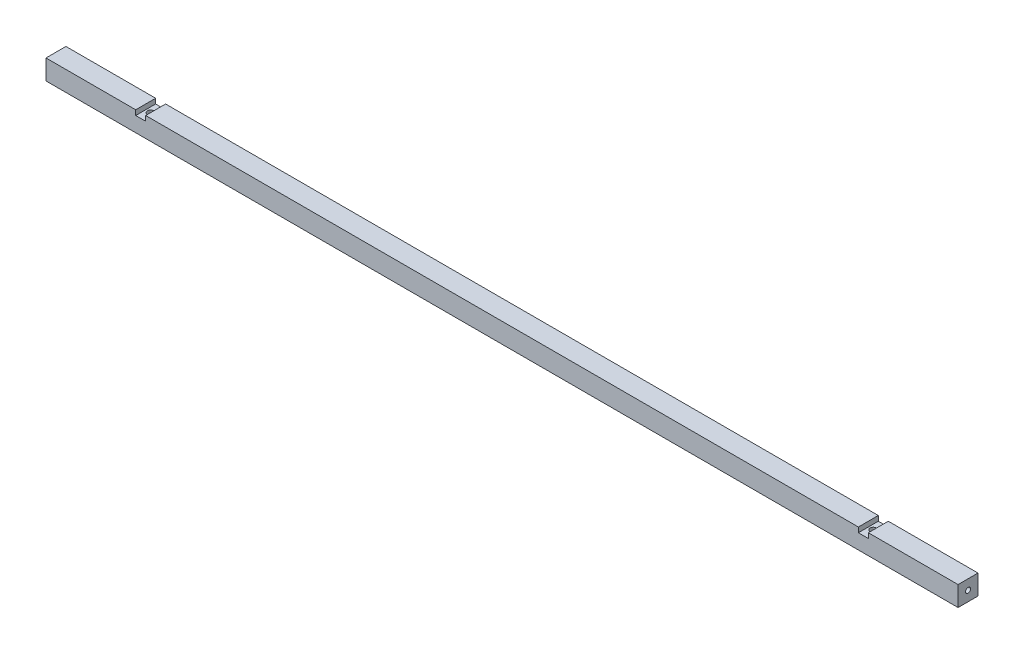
from build123d import *

# Parameters (mm, degrees)
EXTRUSION1_DEPTH                = 10
ENL_V_MAT_EXTRU_1_REACH         = 917.178
ESQUISSE2_R                     = 3.25
TROU_TARAUD_M61_D               = 5
TROU_TARAUD_M61_DEPTH           = 18
TROU_TARAUD_M61_TIP             = 1.502151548
TROU_TARAUD_M61_ON_FACE_2_D     = 5
TROU_TARAUD_M61_ON_FACE_2_DEPTH = 18
TROU_TARAUD_M61_ON_FACE_2_TIP   = 1.502151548


with BuildPart() as part:
    # Esquisse1 → Extrusion1 (new, symmetric)
    with BuildSketch(Plane.XY):
        Polygon((0, 0), (915, 0), (915, 20), (825, 20), (825, 15), (815, 15), (815, 20), (100, 20), (100, 15), (90, 15), (90, 20), (0, 20), align=None)
    extrude(amount=EXTRUSION1_DEPTH, both=True)

    # Esquisse2 → Enl_v. mat.-Extru.1 (cut, up to next)
    with BuildSketch(Plane(origin=(0, 15, 0), x_dir=(-1, 0, 0), z_dir=(0, 1, 0)), mode=Mode.PRIVATE) as enl_v_mat_extru_1_sk1:
        with Locations(Location((-820, 0, 0), (0, 0, 90))):
            Circle(ESQUISSE2_R)
    enl_v_mat_extru_1_tool1 = extrude(enl_v_mat_extru_1_sk1.sketch, amount=-ENL_V_MAT_EXTRU_1_REACH, mode=Mode.PRIVATE) & part.part
    # Esquisse2 → Enl_v. mat.-Extru.1 (cut, up to next)
    with BuildSketch(Plane(origin=(0, 15, 0), x_dir=(-1, 0, 0), z_dir=(0, 1, 0)), mode=Mode.PRIVATE) as enl_v_mat_extru_1_sk2:
        with Locations(Location((-95, 0, 0), (0, 0, 90))):
            Circle(ESQUISSE2_R)
    enl_v_mat_extru_1_tool2 = extrude(enl_v_mat_extru_1_sk2.sketch, amount=-ENL_V_MAT_EXTRU_1_REACH, mode=Mode.PRIVATE) & part.part
    add(enl_v_mat_extru_1_tool1.solids().sort_by_distance((820, 15, 0))[0], mode=Mode.SUBTRACT)
    add(enl_v_mat_extru_1_tool2.solids().sort_by_distance((95, 15, 0))[0], mode=Mode.SUBTRACT)

    # Trou taraud_ M61
    with Locations(Plane(origin=(0, 10, 0), x_dir=(0, -1, 0), z_dir=(-1, 0, 0))):
        with Locations((0, 0)):
            Hole(TROU_TARAUD_M61_D / 2, depth=TROU_TARAUD_M61_DEPTH)
            with Locations((0, 0, -(TROU_TARAUD_M61_DEPTH + TROU_TARAUD_M61_TIP / 2))):  # 118° drill point
                Cone(0, TROU_TARAUD_M61_D / 2, TROU_TARAUD_M61_TIP, mode=Mode.SUBTRACT)

    # Trou taraud_ M61 on face 2
    with Locations(Plane(origin=(915, 10, 0), x_dir=(0, 0, 1), z_dir=(1, 0, 0))):
        with Locations((0, 0)):
            Hole(TROU_TARAUD_M61_ON_FACE_2_D / 2, depth=TROU_TARAUD_M61_ON_FACE_2_DEPTH)
            with Locations((0, 0, -(TROU_TARAUD_M61_ON_FACE_2_DEPTH + TROU_TARAUD_M61_ON_FACE_2_TIP / 2))):  # 118° drill point
                Cone(0, TROU_TARAUD_M61_ON_FACE_2_D / 2, TROU_TARAUD_M61_ON_FACE_2_TIP, mode=Mode.SUBTRACT)


solid = part.part
